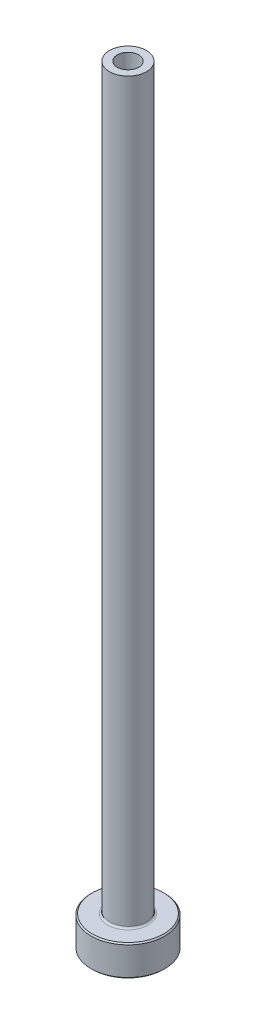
ISO-10303-21;
HEADER;
FILE_DESCRIPTION(('STEP AP214'),'2;1');
FILE_NAME('part.step','',(''),(''),'','','');
FILE_SCHEMA(('AUTOMOTIVE_DESIGN { 1 0 10303 214 1 1 1 1 }'));
ENDSEC;
DATA;
#1=APPLICATION_CONTEXT('core data for automotive mechanical design processes');
#2=APPLICATION_PROTOCOL_DEFINITION('international standard','automotive_design',2000,#1);
#3=PRODUCT_CONTEXT('',#1,'mechanical');
#4=PRODUCT('Part','Part','',(#3));
#5=PRODUCT_RELATED_PRODUCT_CATEGORY('part','',(#4));
#6=PRODUCT_DEFINITION_FORMATION('','',#4);
#7=PRODUCT_DEFINITION_CONTEXT('part definition',#1,'design');
#8=PRODUCT_DEFINITION('design','',#6,#7);
#9=PRODUCT_DEFINITION_SHAPE('','',#8);
#10=(LENGTH_UNIT() NAMED_UNIT(*) SI_UNIT(.MILLI.,.METRE.));
#11=(NAMED_UNIT(*) PLANE_ANGLE_UNIT() SI_UNIT($,.RADIAN.));
#12=(NAMED_UNIT(*) SI_UNIT($,.STERADIAN.) SOLID_ANGLE_UNIT());
#13=UNCERTAINTY_MEASURE_WITH_UNIT(LENGTH_MEASURE(1.E-05),#10,'distance_accuracy_value','');
#14=(GEOMETRIC_REPRESENTATION_CONTEXT(3) GLOBAL_UNCERTAINTY_ASSIGNED_CONTEXT((#13)) GLOBAL_UNIT_ASSIGNED_CONTEXT((#10,
#11,#12)) REPRESENTATION_CONTEXT('',''));
#15=CARTESIAN_POINT('',(0.,0.,0.));
#16=DIRECTION('',(0.,0.,1.));
#17=DIRECTION('',(1.,0.,0.));
#18=AXIS2_PLACEMENT_3D('',#15,#16,#17);
#19=CARTESIAN_POINT('',(0.,92.1876809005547,0.));
#20=DIRECTION('',(0.,1.,0.));
#21=DIRECTION('',(0.,0.,1.));
#22=AXIS2_PLACEMENT_3D('',#19,#20,#21);
#23=CYLINDRICAL_SURFACE('',#22,1.75);
#24=CARTESIAN_POINT('',(0.,125.,0.));
#25=DIRECTION('',(0.,1.,0.));
#26=DIRECTION('',(0.,0.,1.));
#27=AXIS2_PLACEMENT_3D('',#24,#25,#26);
#28=CIRCLE('',#27,1.75);
#29=CARTESIAN_POINT('',(0.,125.,1.75));
#30=VERTEX_POINT('',#29);
#31=EDGE_CURVE('E62',#30,#30,#28,.T.);
#32=ORIENTED_EDGE('',*,*,#31,.T.);
#33=EDGE_LOOP('',(#32));
#34=FACE_BOUND('',#33,.T.);
#35=CARTESIAN_POINT('',(0.,80.,0.));
#36=DIRECTION('',(0.,1.,0.));
#37=DIRECTION('',(0.,0.,1.));
#38=AXIS2_PLACEMENT_3D('',#35,#36,#37);
#39=CIRCLE('',#38,1.75);
#40=CARTESIAN_POINT('',(0.,80.,1.75));
#41=VERTEX_POINT('',#40);
#42=EDGE_CURVE('E71',#41,#41,#39,.T.);
#43=ORIENTED_EDGE('',*,*,#42,.F.);
#44=EDGE_LOOP('',(#43));
#45=FACE_BOUND('',#44,.T.);
#46=ADVANCED_FACE('F30',(#34,#45),#23,.F.);
#47=CARTESIAN_POINT('',(-1.75,125.,0.));
#48=DIRECTION('',(0.,1.,0.));
#49=DIRECTION('',(0.,0.,1.));
#50=AXIS2_PLACEMENT_3D('',#47,#48,#49);
#51=PLANE('',#50);
#52=CARTESIAN_POINT('',(0.,125.,0.));
#53=DIRECTION('',(0.,1.,0.));
#54=DIRECTION('',(0.,0.,1.));
#55=AXIS2_PLACEMENT_3D('',#52,#53,#54);
#56=CIRCLE('',#55,3.);
#57=CARTESIAN_POINT('',(0.,125.,3.));
#58=VERTEX_POINT('',#57);
#59=EDGE_CURVE('E65',#58,#58,#56,.T.);
#60=ORIENTED_EDGE('',*,*,#59,.T.);
#61=EDGE_LOOP('',(#60));
#62=FACE_BOUND('',#61,.T.);
#63=ORIENTED_EDGE('',*,*,#31,.F.);
#64=EDGE_LOOP('',(#63));
#65=FACE_BOUND('',#64,.T.);
#66=ADVANCED_FACE('F79',(#62,#65),#51,.T.);
#67=CARTESIAN_POINT('',(0.,92.1876809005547,0.));
#68=DIRECTION('',(0.,1.,0.));
#69=DIRECTION('',(0.,0.,1.));
#70=AXIS2_PLACEMENT_3D('',#67,#68,#69);
#71=CYLINDRICAL_SURFACE('',#70,3.);
#72=CARTESIAN_POINT('',(0.,5.3,0.));
#73=DIRECTION('',(0.,1.,0.));
#74=DIRECTION('',(0.,0.,1.));
#75=AXIS2_PLACEMENT_3D('',#72,#73,#74);
#76=CIRCLE('',#75,3.);
#77=CARTESIAN_POINT('',(0.,5.3,3.));
#78=VERTEX_POINT('',#77);
#79=EDGE_CURVE('E59',#78,#78,#76,.T.);
#80=ORIENTED_EDGE('',*,*,#79,.T.);
#81=EDGE_LOOP('',(#80));
#82=FACE_BOUND('',#81,.T.);
#83=ORIENTED_EDGE('',*,*,#59,.F.);
#84=EDGE_LOOP('',(#83));
#85=FACE_BOUND('',#84,.T.);
#86=ADVANCED_FACE('F85',(#82,#85),#71,.T.);
#87=CARTESIAN_POINT('',(-2.99999999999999,5.,0.));
#88=DIRECTION('',(0.,1.,0.));
#89=DIRECTION('',(0.,0.,1.));
#90=AXIS2_PLACEMENT_3D('',#87,#88,#89);
#91=PLANE('',#90);
#92=CARTESIAN_POINT('',(0.,5.,0.));
#93=DIRECTION('',(0.,1.,0.));
#94=DIRECTION('',(0.,0.,1.));
#95=AXIS2_PLACEMENT_3D('',#92,#93,#94);
#96=CIRCLE('',#95,5.79999999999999);
#97=CARTESIAN_POINT('',(0.,5.,5.79999999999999));
#98=VERTEX_POINT('',#97);
#99=EDGE_CURVE('E53',#98,#98,#96,.T.);
#100=ORIENTED_EDGE('',*,*,#99,.T.);
#101=EDGE_LOOP('',(#100));
#102=FACE_BOUND('',#101,.T.);
#103=CARTESIAN_POINT('',(0.,5.,0.));
#104=DIRECTION('',(0.,1.,0.));
#105=DIRECTION('',(0.,0.,1.));
#106=AXIS2_PLACEMENT_3D('',#103,#104,#105);
#107=CIRCLE('',#106,3.3);
#108=CARTESIAN_POINT('',(0.,5.,3.3));
#109=VERTEX_POINT('',#108);
#110=EDGE_CURVE('E56',#109,#109,#107,.F.);
#111=ORIENTED_EDGE('',*,*,#110,.T.);
#112=EDGE_LOOP('',(#111));
#113=FACE_BOUND('',#112,.T.);
#114=ADVANCED_FACE('F111',(#102,#113),#91,.T.);
#115=CARTESIAN_POINT('',(0.,92.1876809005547,0.));
#116=DIRECTION('',(0.,1.,0.));
#117=DIRECTION('',(0.,0.,1.));
#118=AXIS2_PLACEMENT_3D('',#115,#116,#117);
#119=CYLINDRICAL_SURFACE('',#118,5.99999999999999);
#120=CARTESIAN_POINT('',(0.,4.8,0.));
#121=DIRECTION('',(0.,1.,0.));
#122=DIRECTION('',(0.,0.,1.));
#123=AXIS2_PLACEMENT_3D('',#120,#121,#122);
#124=CIRCLE('',#123,5.99999999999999);
#125=CARTESIAN_POINT('',(0.,4.8,5.99999999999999));
#126=VERTEX_POINT('',#125);
#127=EDGE_CURVE('E45',#126,#126,#124,.F.);
#128=ORIENTED_EDGE('',*,*,#127,.T.);
#129=EDGE_LOOP('',(#128));
#130=FACE_BOUND('',#129,.T.);
#131=CARTESIAN_POINT('',(0.,0.20000000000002,0.));
#132=DIRECTION('',(0.,-1.,0.));
#133=DIRECTION('',(0.,0.,-1.));
#134=AXIS2_PLACEMENT_3D('',#131,#132,#133);
#135=CIRCLE('',#134,5.99999999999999);
#136=CARTESIAN_POINT('',(0.,0.20000000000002,-5.99999999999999));
#137=VERTEX_POINT('',#136);
#138=EDGE_CURVE('E50',#137,#137,#135,.F.);
#139=ORIENTED_EDGE('',*,*,#138,.T.);
#140=EDGE_LOOP('',(#139));
#141=FACE_BOUND('',#140,.T.);
#142=ADVANCED_FACE('F108',(#130,#141),#119,.T.);
#143=CARTESIAN_POINT('',(-5.99999999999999,0.,0.));
#144=DIRECTION('',(0.,-1.,0.));
#145=DIRECTION('',(0.,0.,-1.));
#146=AXIS2_PLACEMENT_3D('',#143,#144,#145);
#147=PLANE('',#146);
#148=CARTESIAN_POINT('',(0.,0.,0.));
#149=DIRECTION('',(0.,-1.,0.));
#150=DIRECTION('',(0.,0.,-1.));
#151=AXIS2_PLACEMENT_3D('',#148,#149,#150);
#152=CIRCLE('',#151,2.49999999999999);
#153=CARTESIAN_POINT('',(0.,0.,-2.49999999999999));
#154=VERTEX_POINT('',#153);
#155=EDGE_CURVE('E37',#154,#154,#152,.F.);
#156=ORIENTED_EDGE('',*,*,#155,.T.);
#157=EDGE_LOOP('',(#156));
#158=FACE_BOUND('',#157,.T.);
#159=CARTESIAN_POINT('',(0.,0.,0.));
#160=DIRECTION('',(0.,-1.,0.));
#161=DIRECTION('',(0.,0.,-1.));
#162=AXIS2_PLACEMENT_3D('',#159,#160,#161);
#163=CIRCLE('',#162,5.79999999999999);
#164=CARTESIAN_POINT('',(0.,0.,-5.79999999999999));
#165=VERTEX_POINT('',#164);
#166=EDGE_CURVE('E41',#165,#165,#163,.T.);
#167=ORIENTED_EDGE('',*,*,#166,.T.);
#168=EDGE_LOOP('',(#167));
#169=FACE_BOUND('',#168,.T.);
#170=ADVANCED_FACE('F110',(#158,#169),#147,.T.);
#171=CARTESIAN_POINT('',(0.,92.1876809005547,0.));
#172=DIRECTION('',(0.,1.,0.));
#173=DIRECTION('',(0.,0.,1.));
#174=AXIS2_PLACEMENT_3D('',#171,#172,#173);
#175=CYLINDRICAL_SURFACE('',#174,1.99999999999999);
#176=CARTESIAN_POINT('',(0.,0.499999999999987,0.));
#177=DIRECTION('',(0.,-1.,0.));
#178=DIRECTION('',(0.,0.,-1.));
#179=AXIS2_PLACEMENT_3D('',#176,#177,#178);
#180=CIRCLE('',#179,1.99999999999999);
#181=CARTESIAN_POINT('',(0.,0.499999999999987,-1.99999999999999));
#182=VERTEX_POINT('',#181);
#183=EDGE_CURVE('E10',#182,#182,#180,.T.);
#184=ORIENTED_EDGE('',*,*,#183,.T.);
#185=EDGE_LOOP('',(#184));
#186=FACE_BOUND('',#185,.T.);
#187=CARTESIAN_POINT('',(0.,68.,0.));
#188=DIRECTION('',(0.,1.,0.));
#189=DIRECTION('',(0.,0.,1.));
#190=AXIS2_PLACEMENT_3D('',#187,#188,#189);
#191=CIRCLE('',#190,2.);
#192=CARTESIAN_POINT('',(0.,68.,2.));
#193=VERTEX_POINT('',#192);
#194=EDGE_CURVE('E68',#193,#193,#191,.T.);
#195=ORIENTED_EDGE('',*,*,#194,.T.);
#196=EDGE_LOOP('',(#195));
#197=FACE_BOUND('',#196,.T.);
#198=ADVANCED_FACE('F118',(#186,#197),#175,.F.);
#199=CARTESIAN_POINT('',(0.,68.,0.));
#200=DIRECTION('',(0.,-1.,0.));
#201=DIRECTION('',(0.,0.,-1.));
#202=AXIS2_PLACEMENT_3D('',#199,#200,#201);
#203=CONICAL_SURFACE('',#202,2.,0.0208303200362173);
#204=ORIENTED_EDGE('',*,*,#42,.T.);
#205=EDGE_LOOP('',(#204));
#206=FACE_BOUND('',#205,.T.);
#207=ORIENTED_EDGE('',*,*,#194,.F.);
#208=EDGE_LOOP('',(#207));
#209=FACE_BOUND('',#208,.T.);
#210=ADVANCED_FACE('F75',(#206,#209),#203,.F.);
#211=CARTESIAN_POINT('',(0.,5.3,0.));
#212=DIRECTION('',(0.,1.,0.));
#213=DIRECTION('',(0.,0.,1.));
#214=AXIS2_PLACEMENT_3D('',#211,#212,#213);
#215=TOROIDAL_SURFACE('',#214,3.3,0.3);
#216=ORIENTED_EDGE('',*,*,#110,.F.);
#217=EDGE_LOOP('',(#216));
#218=FACE_BOUND('',#217,.T.);
#219=ORIENTED_EDGE('',*,*,#79,.F.);
#220=EDGE_LOOP('',(#219));
#221=FACE_BOUND('',#220,.T.);
#222=ADVANCED_FACE('F90',(#218,#221),#215,.F.);
#223=CARTESIAN_POINT('',(0.,5.,0.));
#224=DIRECTION('',(0.,-1.,0.));
#225=DIRECTION('',(0.,0.,-1.));
#226=AXIS2_PLACEMENT_3D('',#223,#224,#225);
#227=CONICAL_SURFACE('',#226,5.79999999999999,0.785398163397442);
#228=ORIENTED_EDGE('',*,*,#127,.F.);
#229=EDGE_LOOP('',(#228));
#230=FACE_BOUND('',#229,.T.);
#231=ORIENTED_EDGE('',*,*,#99,.F.);
#232=EDGE_LOOP('',(#231));
#233=FACE_BOUND('',#232,.T.);
#234=ADVANCED_FACE('F93',(#230,#233),#227,.T.);
#235=CARTESIAN_POINT('',(0.,0.20000000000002,0.));
#236=DIRECTION('',(0.,1.,0.));
#237=DIRECTION('',(0.,0.,1.));
#238=AXIS2_PLACEMENT_3D('',#235,#236,#237);
#239=CONICAL_SURFACE('',#238,5.99999999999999,0.785398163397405);
#240=ORIENTED_EDGE('',*,*,#166,.F.);
#241=EDGE_LOOP('',(#240));
#242=FACE_BOUND('',#241,.T.);
#243=ORIENTED_EDGE('',*,*,#138,.F.);
#244=EDGE_LOOP('',(#243));
#245=FACE_BOUND('',#244,.T.);
#246=ADVANCED_FACE('F96',(#242,#245),#239,.T.);
#247=CARTESIAN_POINT('',(0.,0.,0.));
#248=DIRECTION('',(0.,-1.,0.));
#249=DIRECTION('',(0.,0.,-1.));
#250=AXIS2_PLACEMENT_3D('',#247,#248,#249);
#251=CONICAL_SURFACE('',#250,2.49999999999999,0.785398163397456);
#252=ORIENTED_EDGE('',*,*,#183,.F.);
#253=EDGE_LOOP('',(#252));
#254=FACE_BOUND('',#253,.T.);
#255=ORIENTED_EDGE('',*,*,#155,.F.);
#256=EDGE_LOOP('',(#255));
#257=FACE_BOUND('',#256,.T.);
#258=ADVANCED_FACE('F32',(#254,#257),#251,.F.);
#259=CLOSED_SHELL('',(#46,#66,#86,#114,#142,#170,#198,#210,#222,#234,#246,#258));
#260=MANIFOLD_SOLID_BREP('B2',#259);
#261=ADVANCED_BREP_SHAPE_REPRESENTATION('',(#18,#260),#14);
#262=SHAPE_DEFINITION_REPRESENTATION(#9,#261);
ENDSEC;
END-ISO-10303-21;
